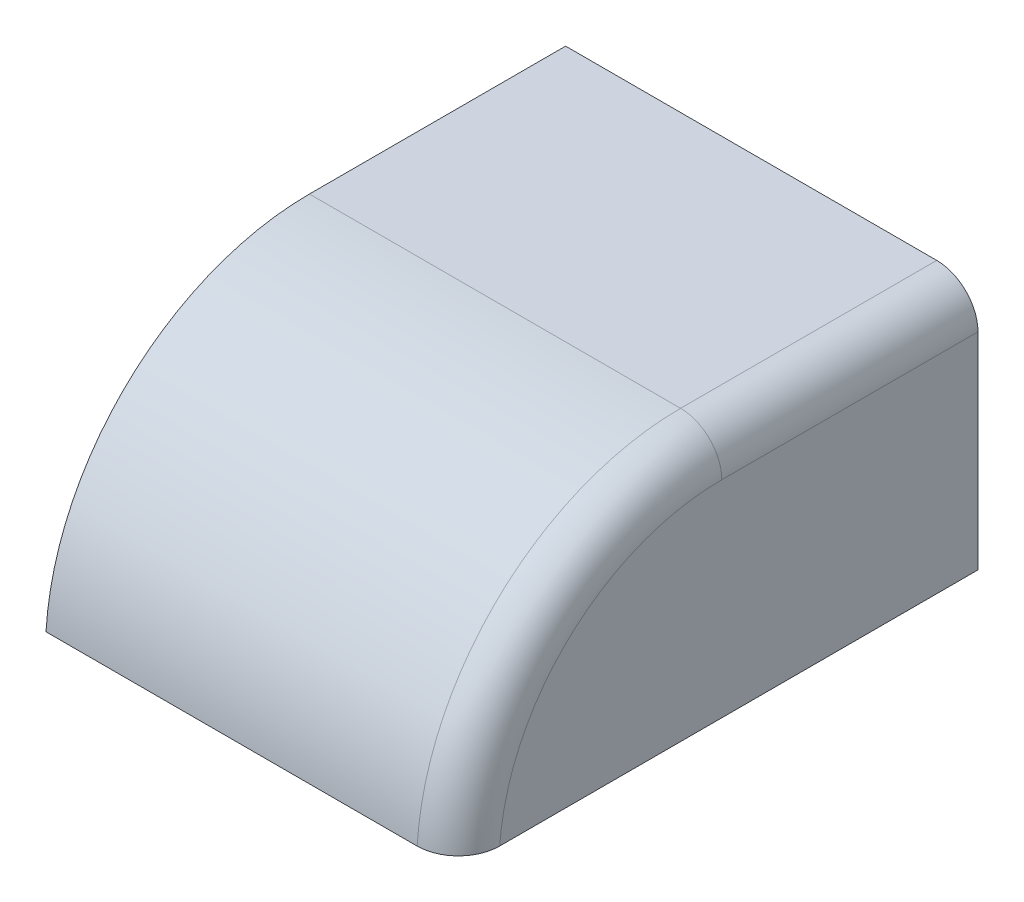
ISO-10303-21;
HEADER;
FILE_DESCRIPTION(('STEP AP214'),'2;1');
FILE_NAME('part.step','',(''),(''),'','','');
FILE_SCHEMA(('AUTOMOTIVE_DESIGN { 1 0 10303 214 1 1 1 1 }'));
ENDSEC;
DATA;
#1=APPLICATION_CONTEXT('core data for automotive mechanical design processes');
#2=APPLICATION_PROTOCOL_DEFINITION('international standard','automotive_design',2000,#1);
#3=PRODUCT_CONTEXT('',#1,'mechanical');
#4=PRODUCT('Part','Part','',(#3));
#5=PRODUCT_RELATED_PRODUCT_CATEGORY('part','',(#4));
#6=PRODUCT_DEFINITION_FORMATION('','',#4);
#7=PRODUCT_DEFINITION_CONTEXT('part definition',#1,'design');
#8=PRODUCT_DEFINITION('design','',#6,#7);
#9=PRODUCT_DEFINITION_SHAPE('','',#8);
#10=(LENGTH_UNIT() NAMED_UNIT(*) SI_UNIT(.MILLI.,.METRE.));
#11=(NAMED_UNIT(*) PLANE_ANGLE_UNIT() SI_UNIT($,.RADIAN.));
#12=(NAMED_UNIT(*) SI_UNIT($,.STERADIAN.) SOLID_ANGLE_UNIT());
#13=UNCERTAINTY_MEASURE_WITH_UNIT(LENGTH_MEASURE(1.E-05),#10,'distance_accuracy_value','');
#14=(GEOMETRIC_REPRESENTATION_CONTEXT(3) GLOBAL_UNCERTAINTY_ASSIGNED_CONTEXT((#13)) GLOBAL_UNIT_ASSIGNED_CONTEXT((#10,
#11,#12)) REPRESENTATION_CONTEXT('',''));
#15=CARTESIAN_POINT('',(0.,0.,0.));
#16=DIRECTION('',(0.,0.,1.));
#17=DIRECTION('',(1.,0.,0.));
#18=AXIS2_PLACEMENT_3D('',#15,#16,#17);
#19=CARTESIAN_POINT('',(0.,30.,63.));
#20=DIRECTION('',(0.,-1.,0.));
#21=DIRECTION('',(0.,0.,-1.));
#22=AXIS2_PLACEMENT_3D('',#19,#20,#21);
#23=PLANE('',#22);
#24=DIRECTION('',(1.,0.,0.));
#25=VECTOR('',#24,1.);
#26=CARTESIAN_POINT('',(0.,30.,31.0625611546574));
#27=LINE('',#26,#25);
#28=CARTESIAN_POINT('',(0.,30.,31.0625611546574));
#29=VERTEX_POINT('',#28);
#30=CARTESIAN_POINT('',(45.,30.,31.0625611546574));
#31=VERTEX_POINT('',#30);
#32=EDGE_CURVE('E118',#29,#31,#27,.T.);
#33=ORIENTED_EDGE('',*,*,#32,.T.);
#34=DIRECTION('',(0.,0.,-1.));
#35=VECTOR('',#34,1.);
#36=CARTESIAN_POINT('',(45.,30.,63.));
#37=LINE('',#36,#35);
#38=CARTESIAN_POINT('',(45.,30.,0.));
#39=VERTEX_POINT('',#38);
#40=EDGE_CURVE('E41',#31,#39,#37,.T.);
#41=ORIENTED_EDGE('',*,*,#40,.T.);
#42=DIRECTION('',(-1.,0.,0.));
#43=VECTOR('',#42,1.);
#44=CARTESIAN_POINT('',(0.,30.,0.));
#45=LINE('',#44,#43);
#46=CARTESIAN_POINT('',(0.,30.,0.));
#47=VERTEX_POINT('',#46);
#48=EDGE_CURVE('E112',#39,#47,#45,.T.);
#49=ORIENTED_EDGE('',*,*,#48,.T.);
#50=DIRECTION('',(0.,0.,-1.));
#51=VECTOR('',#50,1.);
#52=CARTESIAN_POINT('',(0.,30.,63.));
#53=LINE('',#52,#51);
#54=EDGE_CURVE('E105',#29,#47,#53,.T.);
#55=ORIENTED_EDGE('',*,*,#54,.F.);
#56=EDGE_LOOP('',(#33,#41,#49,#55));
#57=FACE_BOUND('',#56,.T.);
#58=ADVANCED_FACE('F33',(#57),#23,.F.);
#59=CARTESIAN_POINT('',(0.,0.,63.));
#60=DIRECTION('',(1.,0.,0.));
#61=DIRECTION('',(0.,0.,-1.));
#62=AXIS2_PLACEMENT_3D('',#59,#60,#61);
#63=PLANE('',#62);
#64=DIRECTION('',(0.,0.,-1.));
#65=VECTOR('',#64,1.);
#66=CARTESIAN_POINT('',(0.,0.,63.));
#67=LINE('',#66,#65);
#68=CARTESIAN_POINT('',(0.,0.,63.));
#69=VERTEX_POINT('',#68);
#70=CARTESIAN_POINT('',(0.,0.,0.));
#71=VERTEX_POINT('',#70);
#72=EDGE_CURVE('E96',#69,#71,#67,.T.);
#73=ORIENTED_EDGE('',*,*,#72,.F.);
#74=CARTESIAN_POINT('',(0.,-2.,31.0625611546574));
#75=DIRECTION('',(1.,0.,0.));
#76=DIRECTION('',(0.,0.,-1.));
#77=AXIS2_PLACEMENT_3D('',#74,#75,#76);
#78=CIRCLE('',#77,32.);
#79=EDGE_CURVE('E100',#69,#29,#78,.F.);
#80=ORIENTED_EDGE('',*,*,#79,.T.);
#81=ORIENTED_EDGE('',*,*,#54,.T.);
#82=DIRECTION('',(0.,-1.,0.));
#83=VECTOR('',#82,1.);
#84=CARTESIAN_POINT('',(0.,0.,0.));
#85=LINE('',#84,#83);
#86=EDGE_CURVE('E88',#47,#71,#85,.T.);
#87=ORIENTED_EDGE('',*,*,#86,.T.);
#88=EDGE_LOOP('',(#73,#80,#81,#87));
#89=FACE_BOUND('',#88,.T.);
#90=ADVANCED_FACE('F35',(#89),#63,.F.);
#91=CARTESIAN_POINT('',(0.,0.,63.));
#92=DIRECTION('',(0.,1.,0.));
#93=DIRECTION('',(0.,0.,1.));
#94=AXIS2_PLACEMENT_3D('',#91,#92,#93);
#95=PLANE('',#94);
#96=DIRECTION('',(0.,0.,-1.));
#97=VECTOR('',#96,1.);
#98=CARTESIAN_POINT('',(50.,0.,63.));
#99=LINE('',#98,#97);
#100=CARTESIAN_POINT('',(50.,0.,57.9883851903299));
#101=VERTEX_POINT('',#100);
#102=CARTESIAN_POINT('',(50.,0.,0.));
#103=VERTEX_POINT('',#102);
#104=EDGE_CURVE('E101',#101,#103,#99,.T.);
#105=ORIENTED_EDGE('',*,*,#104,.F.);
#106=CARTESIAN_POINT('',(50.,0.,57.9883851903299));
#107=CARTESIAN_POINT('',(50.0000149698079,0.,58.1296030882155));
#108=CARTESIAN_POINT('',(49.9940507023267,0.,58.2708192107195));
#109=CARTESIAN_POINT('',(49.9702684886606,0.,58.5522445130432));
#110=CARTESIAN_POINT('',(49.9524510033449,0.,58.6924537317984));
#111=CARTESIAN_POINT('',(49.9050829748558,0.,58.9707798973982));
#112=CARTESIAN_POINT('',(49.8755402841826,0.,59.1088981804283));
#113=CARTESIAN_POINT('',(49.8049312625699,0.,59.3821549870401));
#114=CARTESIAN_POINT('',(49.7638650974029,0.,59.5172935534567));
#115=CARTESIAN_POINT('',(49.6704772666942,0.,59.7836774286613));
#116=CARTESIAN_POINT('',(49.6181516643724,0.,59.9149213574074));
#117=CARTESIAN_POINT('',(49.502598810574,0.,60.1725773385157));
#118=CARTESIAN_POINT('',(49.4393675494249,0.,60.2989875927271));
#119=CARTESIAN_POINT('',(49.3024998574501,0.,60.5459511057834));
#120=CARTESIAN_POINT('',(49.2288692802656,0.,60.666507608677));
#121=CARTESIAN_POINT('',(49.0716681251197,0.,60.9010167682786));
#122=CARTESIAN_POINT('',(48.9880941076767,0.,61.0149671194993));
#123=CARTESIAN_POINT('',(48.8117666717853,0.,61.2352147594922));
#124=CARTESIAN_POINT('',(48.7190289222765,0.,61.3415245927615));
#125=CARTESIAN_POINT('',(48.5249132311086,0.,61.5459392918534));
#126=CARTESIAN_POINT('',(48.4235353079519,0.,61.6440441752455));
#127=CARTESIAN_POINT('',(48.2128190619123,0.,61.83137923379));
#128=CARTESIAN_POINT('',(48.1034777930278,0.,61.9206060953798));
#129=CARTESIAN_POINT('',(47.8776858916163,0.,62.0894714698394));
#130=CARTESIAN_POINT('',(47.761237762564,0.,62.1691133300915));
#131=CARTESIAN_POINT('',(47.5222262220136,0.,62.3181467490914));
#132=CARTESIAN_POINT('',(47.3996733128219,0.,62.38755515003));
#133=CARTESIAN_POINT('',(47.149193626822,0.,62.5157566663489));
#134=CARTESIAN_POINT('',(47.0212688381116,0.,62.5745536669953));
#135=CARTESIAN_POINT('',(46.7609482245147,0.,62.6811244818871));
#136=CARTESIAN_POINT('',(46.6285537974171,0.,62.7289017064));
#137=CARTESIAN_POINT('',(46.360257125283,0.,62.8131000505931));
#138=CARTESIAN_POINT('',(46.2243557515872,0.,62.8495239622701));
#139=CARTESIAN_POINT('',(45.9087407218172,0.,62.919960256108));
#140=CARTESIAN_POINT('',(45.728109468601,0.,62.9499742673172));
#141=CARTESIAN_POINT('',(45.4557367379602,0.,62.9799862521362));
#142=CARTESIAN_POINT('',(45.3647549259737,0.,62.9874887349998));
#143=CARTESIAN_POINT('',(45.1825227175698,0.,62.9974950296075));
#144=CARTESIAN_POINT('',(45.0912723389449,0.,62.9999991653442));
#145=CARTESIAN_POINT('',(45.,0.,63.));
#146=B_SPLINE_CURVE_WITH_KNOTS('',3,(#106,#107,#108,#109,#110,#111,#112,#113,#114,#115,#116,
#117,#118,#119,#120,#121,#122,#123,#124,#125,#126,#127,#128,#129,#130,#131,#132,#133,#134,#135,
#136,#137,#138,#139,#140,#141,#142,#143,#144,#145),.UNSPECIFIED.,.F.,.F.,(4,2,2,2,2,2,2,2,2,2,2,
2,2,2,2,2,2,2,2,4),(0.,0.423525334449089,0.847034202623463,1.27025991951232,1.69347954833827,
2.11684739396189,2.54037123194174,2.96365761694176,3.38709084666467,3.8098121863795,
4.23253262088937,4.65541024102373,5.07813974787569,5.50016556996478,5.92203655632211,
6.34377681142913,6.76541327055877,7.3134843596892,7.58724095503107,7.86097980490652),.UNSPECIFIED.);
#147=CARTESIAN_POINT('',(45.,0.,63.));
#148=VERTEX_POINT('',#147);
#149=EDGE_CURVE('E125',#101,#148,#146,.T.);
#150=ORIENTED_EDGE('',*,*,#149,.T.);
#151=DIRECTION('',(1.,0.,0.));
#152=VECTOR('',#151,1.);
#153=CARTESIAN_POINT('',(0.,0.,63.));
#154=LINE('',#153,#152);
#155=EDGE_CURVE('E98',#69,#148,#154,.T.);
#156=ORIENTED_EDGE('',*,*,#155,.F.);
#157=ORIENTED_EDGE('',*,*,#72,.T.);
#158=DIRECTION('',(1.,0.,0.));
#159=VECTOR('',#158,1.);
#160=CARTESIAN_POINT('',(0.,0.,0.));
#161=LINE('',#160,#159);
#162=EDGE_CURVE('E84',#71,#103,#161,.T.);
#163=ORIENTED_EDGE('',*,*,#162,.T.);
#164=EDGE_LOOP('',(#105,#150,#156,#157,#163));
#165=FACE_BOUND('',#164,.T.);
#166=ADVANCED_FACE('F97',(#165),#95,.F.);
#167=CARTESIAN_POINT('',(50.,0.,63.));
#168=DIRECTION('',(-1.,0.,0.));
#169=DIRECTION('',(0.,0.,1.));
#170=AXIS2_PLACEMENT_3D('',#167,#168,#169);
#171=PLANE('',#170);
#172=DIRECTION('',(0.,0.,-1.));
#173=VECTOR('',#172,1.);
#174=CARTESIAN_POINT('',(50.,25.,63.));
#175=LINE('',#174,#173);
#176=CARTESIAN_POINT('',(50.,25.,0.));
#177=VERTEX_POINT('',#176);
#178=CARTESIAN_POINT('',(50.,25.,31.0625611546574));
#179=VERTEX_POINT('',#178);
#180=EDGE_CURVE('E120',#177,#179,#175,.F.);
#181=ORIENTED_EDGE('',*,*,#180,.T.);
#182=CARTESIAN_POINT('',(50.,-2.,31.0625611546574));
#183=DIRECTION('',(-1.,0.,0.));
#184=DIRECTION('',(0.,0.,1.));
#185=AXIS2_PLACEMENT_3D('',#182,#183,#184);
#186=CIRCLE('',#185,27.);
#187=EDGE_CURVE('E122',#179,#101,#186,.F.);
#188=ORIENTED_EDGE('',*,*,#187,.T.);
#189=ORIENTED_EDGE('',*,*,#104,.T.);
#190=DIRECTION('',(0.,1.,0.));
#191=VECTOR('',#190,1.);
#192=CARTESIAN_POINT('',(50.,0.,0.));
#193=LINE('',#192,#191);
#194=EDGE_CURVE('E90',#103,#177,#193,.T.);
#195=ORIENTED_EDGE('',*,*,#194,.T.);
#196=EDGE_LOOP('',(#181,#188,#189,#195));
#197=FACE_BOUND('',#196,.T.);
#198=ADVANCED_FACE('F137',(#197),#171,.F.);
#199=CARTESIAN_POINT('',(0.,30.,0.));
#200=DIRECTION('',(0.,0.,-1.));
#201=DIRECTION('',(-1.,0.,0.));
#202=AXIS2_PLACEMENT_3D('',#199,#200,#201);
#203=PLANE('',#202);
#204=ORIENTED_EDGE('',*,*,#48,.F.);
#205=CARTESIAN_POINT('',(45.,25.,0.));
#206=DIRECTION('',(0.,0.,-1.));
#207=DIRECTION('',(-1.,0.,0.));
#208=AXIS2_PLACEMENT_3D('',#205,#206,#207);
#209=CIRCLE('',#208,5.);
#210=EDGE_CURVE('E11',#39,#177,#209,.T.);
#211=ORIENTED_EDGE('',*,*,#210,.T.);
#212=ORIENTED_EDGE('',*,*,#194,.F.);
#213=ORIENTED_EDGE('',*,*,#162,.F.);
#214=ORIENTED_EDGE('',*,*,#86,.F.);
#215=EDGE_LOOP('',(#204,#211,#212,#213,#214));
#216=FACE_BOUND('',#215,.T.);
#217=ADVANCED_FACE('F86',(#216),#203,.T.);
#218=CARTESIAN_POINT('',(0.,-2.,31.0625611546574));
#219=DIRECTION('',(1.,0.,0.));
#220=DIRECTION('',(0.,0.,-1.));
#221=AXIS2_PLACEMENT_3D('',#218,#219,#220);
#222=CYLINDRICAL_SURFACE('',#221,32.);
#223=ORIENTED_EDGE('',*,*,#155,.T.);
#224=CARTESIAN_POINT('',(45.,-2.,31.0625611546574));
#225=DIRECTION('',(-1.,0.,0.));
#226=DIRECTION('',(0.,0.,1.));
#227=AXIS2_PLACEMENT_3D('',#224,#225,#226);
#228=CIRCLE('',#227,32.);
#229=EDGE_CURVE('E55',#148,#31,#228,.T.);
#230=ORIENTED_EDGE('',*,*,#229,.T.);
#231=ORIENTED_EDGE('',*,*,#32,.F.);
#232=ORIENTED_EDGE('',*,*,#79,.F.);
#233=EDGE_LOOP('',(#223,#230,#231,#232));
#234=FACE_BOUND('',#233,.T.);
#235=ADVANCED_FACE('F145',(#234),#222,.T.);
#236=CARTESIAN_POINT('',(45.,25.,63.));
#237=DIRECTION('',(0.,0.,-1.));
#238=DIRECTION('',(-1.,0.,0.));
#239=AXIS2_PLACEMENT_3D('',#236,#237,#238);
#240=CYLINDRICAL_SURFACE('',#239,5.);
#241=ORIENTED_EDGE('',*,*,#210,.F.);
#242=ORIENTED_EDGE('',*,*,#40,.F.);
#243=CARTESIAN_POINT('',(45.,25.,31.0625611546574));
#244=DIRECTION('',(0.,0.,1.));
#245=DIRECTION('',(1.,0.,0.));
#246=AXIS2_PLACEMENT_3D('',#243,#244,#245);
#247=CIRCLE('',#246,5.);
#248=EDGE_CURVE('E106',#179,#31,#247,.T.);
#249=ORIENTED_EDGE('',*,*,#248,.F.);
#250=ORIENTED_EDGE('',*,*,#180,.F.);
#251=EDGE_LOOP('',(#241,#242,#249,#250));
#252=FACE_BOUND('',#251,.T.);
#253=ADVANCED_FACE('F147',(#252),#240,.T.);
#254=CARTESIAN_POINT('',(45.,-2.,31.0625611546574));
#255=DIRECTION('',(-1.,0.,0.));
#256=DIRECTION('',(0.,0.,1.));
#257=AXIS2_PLACEMENT_3D('',#254,#255,#256);
#258=TOROIDAL_SURFACE('',#257,27.,5.);
#259=ORIENTED_EDGE('',*,*,#248,.T.);
#260=ORIENTED_EDGE('',*,*,#229,.F.);
#261=ORIENTED_EDGE('',*,*,#149,.F.);
#262=ORIENTED_EDGE('',*,*,#187,.F.);
#263=EDGE_LOOP('',(#259,#260,#261,#262));
#264=FACE_BOUND('',#263,.T.);
#265=ADVANCED_FACE('F131',(#264),#258,.T.);
#266=CLOSED_SHELL('',(#58,#90,#166,#198,#217,#235,#253,#265));
#267=MANIFOLD_SOLID_BREP('B2',#266);
#268=ADVANCED_BREP_SHAPE_REPRESENTATION('',(#18,#267),#14);
#269=SHAPE_DEFINITION_REPRESENTATION(#9,#268);
ENDSEC;
END-ISO-10303-21;
